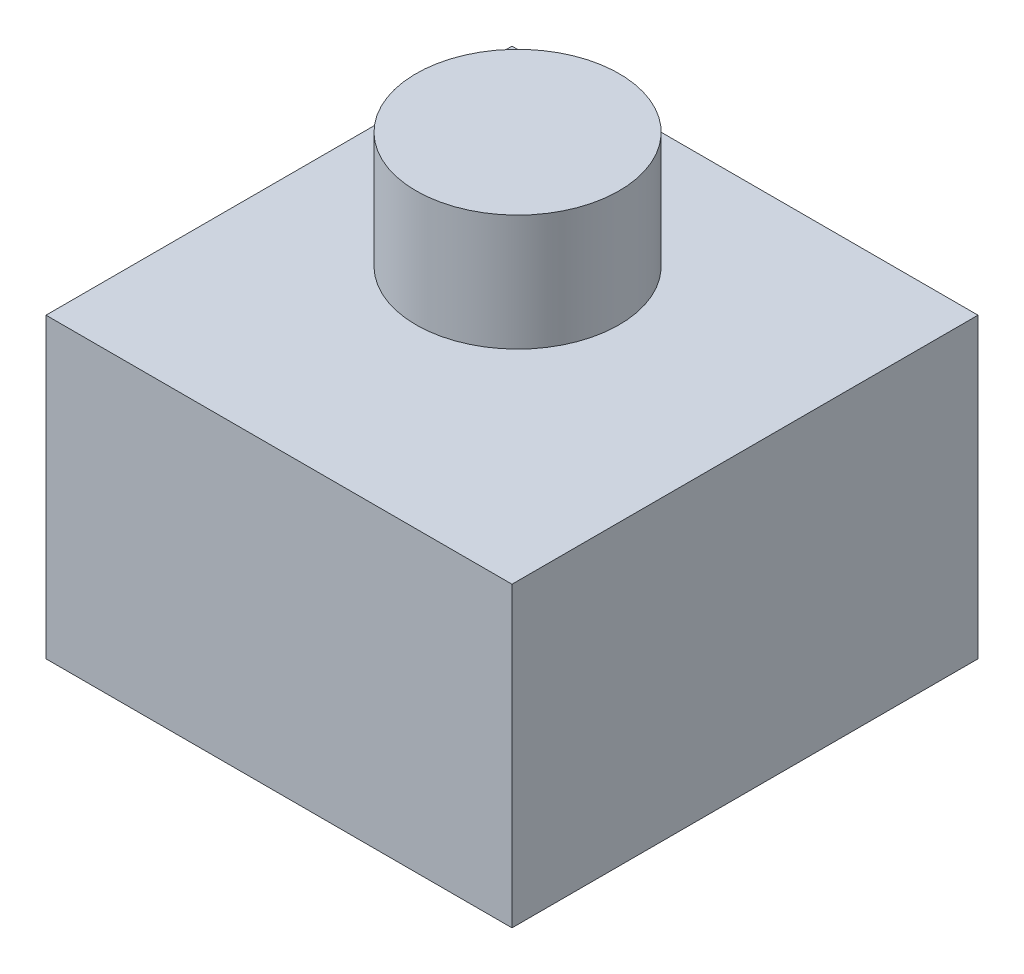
from build123d import *

# Parameters (mm, degrees)
SKETCH1_W      = 97.52724138
SKETCH1_H      = 97.52724138
EXTRUDE1_DEPTH = 62.290520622
SKETCH2_R      = 21.253591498
EXTRUDE2_DEPTH = 24.290520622


with BuildPart() as part:
    # Sketch1 → Extrude1 (new body)
    with BuildSketch(Plane(origin=(0, 0, 0), x_dir=(1, 0, 0), z_dir=(0, 1, 0))):
        Rectangle(SKETCH1_W, SKETCH1_H)
    extrude(amount=EXTRUDE1_DEPTH)

    # Sketch2 → Extrude2 (add)
    with BuildSketch(Plane(origin=(0, 62.290520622, 0), x_dir=(-1, 0, 0), z_dir=(0, 1, 0))):
        with Locations(Location((8.283257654, -9.452987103, 0), (0, 0, 90))):
            Circle(SKETCH2_R)
    extrude(amount=EXTRUDE2_DEPTH)


solid = part.part
